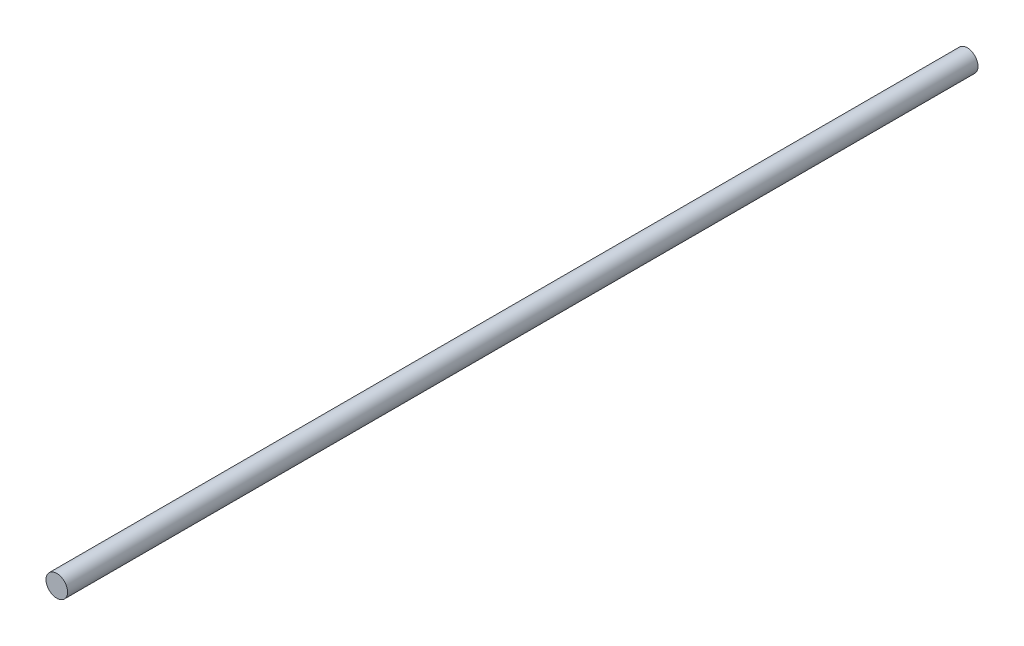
from build123d import *

# Parameters (mm, degrees)
SKETCH1_R           = 6.35
BOSS_EXTRUDE1_DEPTH = 268


with BuildPart() as part:
    # Sketch1 → Boss-Extrude1 (new, symmetric)
    with BuildSketch(Plane.XY):
        Circle(SKETCH1_R)
    extrude(amount=BOSS_EXTRUDE1_DEPTH, both=True)


solid = part.part
